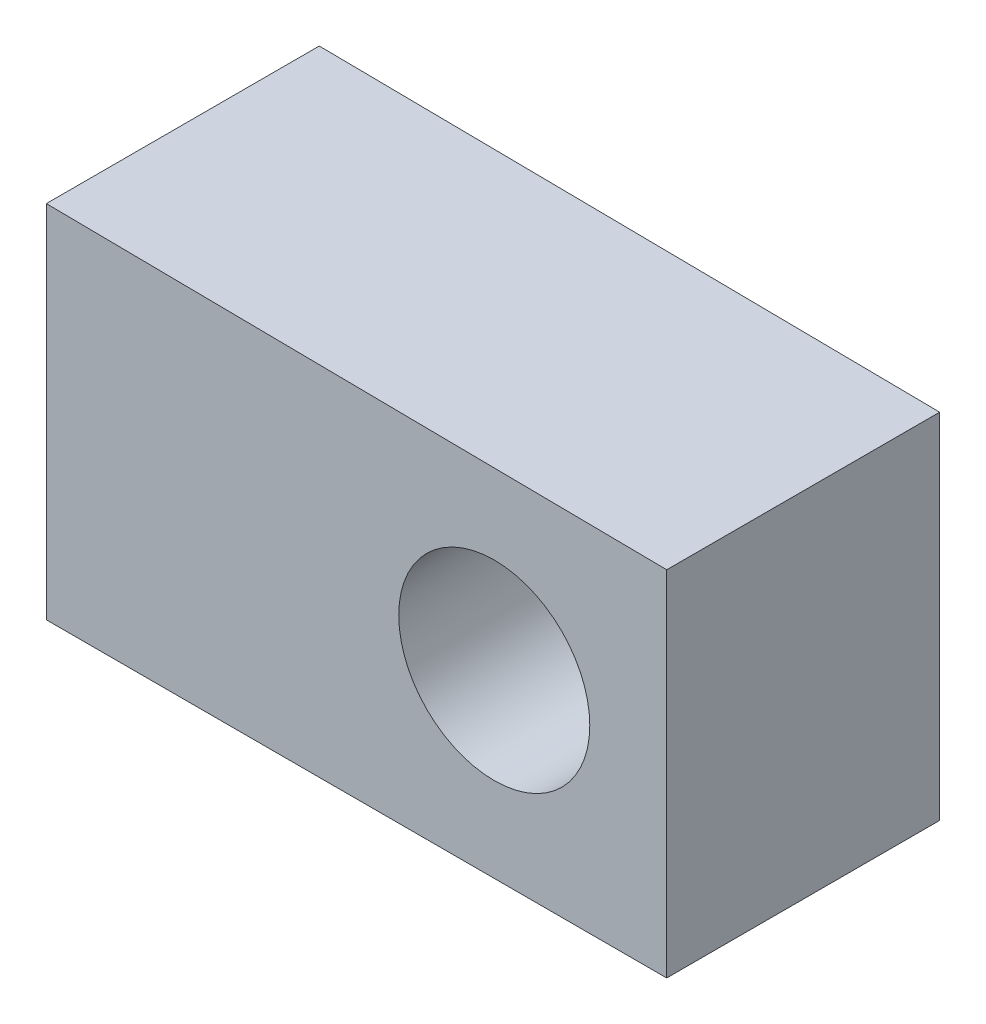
ISO-10303-21;
HEADER;
FILE_DESCRIPTION(('STEP AP214'),'2;1');
FILE_NAME('part.step','',(''),(''),'','','');
FILE_SCHEMA(('AUTOMOTIVE_DESIGN { 1 0 10303 214 1 1 1 1 }'));
ENDSEC;
DATA;
#1=APPLICATION_CONTEXT('core data for automotive mechanical design processes');
#2=APPLICATION_PROTOCOL_DEFINITION('international standard','automotive_design',2000,#1);
#3=PRODUCT_CONTEXT('',#1,'mechanical');
#4=PRODUCT('Part','Part','',(#3));
#5=PRODUCT_RELATED_PRODUCT_CATEGORY('part','',(#4));
#6=PRODUCT_DEFINITION_FORMATION('','',#4);
#7=PRODUCT_DEFINITION_CONTEXT('part definition',#1,'design');
#8=PRODUCT_DEFINITION('design','',#6,#7);
#9=PRODUCT_DEFINITION_SHAPE('','',#8);
#10=(LENGTH_UNIT() NAMED_UNIT(*) SI_UNIT(.MILLI.,.METRE.));
#11=(NAMED_UNIT(*) PLANE_ANGLE_UNIT() SI_UNIT($,.RADIAN.));
#12=(NAMED_UNIT(*) SI_UNIT($,.STERADIAN.) SOLID_ANGLE_UNIT());
#13=UNCERTAINTY_MEASURE_WITH_UNIT(LENGTH_MEASURE(1.E-05),#10,'distance_accuracy_value','');
#14=(GEOMETRIC_REPRESENTATION_CONTEXT(3) GLOBAL_UNCERTAINTY_ASSIGNED_CONTEXT((#13)) GLOBAL_UNIT_ASSIGNED_CONTEXT((#10,
#11,#12)) REPRESENTATION_CONTEXT('',''));
#15=CARTESIAN_POINT('',(0.,0.,0.));
#16=DIRECTION('',(0.,0.,1.));
#17=DIRECTION('',(1.,0.,0.));
#18=AXIS2_PLACEMENT_3D('',#15,#16,#17);
#19=CARTESIAN_POINT('',(0.,0.,10.));
#20=DIRECTION('',(0.,0.,-1.));
#21=DIRECTION('',(-1.,0.,0.));
#22=AXIS2_PLACEMENT_3D('',#19,#20,#21);
#23=PLANE('',#22);
#24=DIRECTION('',(-0.999937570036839,0.0111738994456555,0.));
#25=VECTOR('',#24,1.);
#26=CARTESIAN_POINT('',(31518.8657143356,62891.7491711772,10.));
#27=LINE('',#26,#25);
#28=CARTESIAN_POINT('',(31541.595840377,62891.4951711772,10.));
#29=VERTEX_POINT('',#28);
#30=CARTESIAN_POINT('',(31518.8657143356,62891.7491711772,10.));
#31=VERTEX_POINT('',#30);
#32=EDGE_CURVE('E85',#29,#31,#27,.T.);
#33=ORIENTED_EDGE('',*,*,#32,.T.);
#34=DIRECTION('',(8.06945868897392E-13,-1.,0.));
#35=VECTOR('',#34,1.);
#36=CARTESIAN_POINT('',(31518.8657143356,62878.5411711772,10.));
#37=LINE('',#36,#35);
#38=CARTESIAN_POINT('',(31518.8657143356,62878.5411711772,10.));
#39=VERTEX_POINT('',#38);
#40=EDGE_CURVE('E80',#31,#39,#37,.T.);
#41=ORIENTED_EDGE('',*,*,#40,.T.);
#42=DIRECTION('',(1.,1.5629977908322E-12,0.));
#43=VECTOR('',#42,1.);
#44=CARTESIAN_POINT('',(31541.595840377,62878.5411711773,10.));
#45=LINE('',#44,#43);
#46=CARTESIAN_POINT('',(31541.595840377,62878.5411711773,10.));
#47=VERTEX_POINT('',#46);
#48=EDGE_CURVE('E83',#39,#47,#45,.T.);
#49=ORIENTED_EDGE('',*,*,#48,.T.);
#50=DIRECTION('',(-1.09702444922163E-12,1.,0.));
#51=VECTOR('',#50,1.);
#52=CARTESIAN_POINT('',(31541.595840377,62891.4951711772,10.));
#53=LINE('',#52,#51);
#54=EDGE_CURVE('E50',#47,#29,#53,.T.);
#55=ORIENTED_EDGE('',*,*,#54,.T.);
#56=EDGE_LOOP('',(#33,#41,#49,#55));
#57=FACE_BOUND('',#56,.T.);
#58=CARTESIAN_POINT('',(31535.2771043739,62885.1453563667,10.));
#59=DIRECTION('',(0.,0.,1.));
#60=DIRECTION('',(1.,0.,0.));
#61=AXIS2_PLACEMENT_3D('',#58,#59,#60);
#62=CIRCLE('',#61,3.49999999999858);
#63=CARTESIAN_POINT('',(31538.7771043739,62885.1453563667,10.));
#64=VERTEX_POINT('',#63);
#65=EDGE_CURVE('E100',#64,#64,#62,.T.);
#66=ORIENTED_EDGE('',*,*,#65,.F.);
#67=EDGE_LOOP('',(#66));
#68=FACE_BOUND('',#67,.T.);
#69=ADVANCED_FACE('F33',(#57,#68),#23,.F.);
#70=CARTESIAN_POINT('',(0.,0.,0.));
#71=DIRECTION('',(0.,0.,-1.));
#72=DIRECTION('',(-1.,0.,0.));
#73=AXIS2_PLACEMENT_3D('',#70,#71,#72);
#74=PLANE('',#73);
#75=DIRECTION('',(-0.999937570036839,0.0111738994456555,0.));
#76=VECTOR('',#75,1.);
#77=CARTESIAN_POINT('',(31518.8657143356,62891.7491711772,0.));
#78=LINE('',#77,#76);
#79=CARTESIAN_POINT('',(31541.595840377,62891.4951711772,0.));
#80=VERTEX_POINT('',#79);
#81=CARTESIAN_POINT('',(31518.8657143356,62891.7491711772,0.));
#82=VERTEX_POINT('',#81);
#83=EDGE_CURVE('E97',#80,#82,#78,.T.);
#84=ORIENTED_EDGE('',*,*,#83,.F.);
#85=DIRECTION('',(-1.09702444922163E-12,1.,0.));
#86=VECTOR('',#85,1.);
#87=CARTESIAN_POINT('',(31541.595840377,62891.4951711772,0.));
#88=LINE('',#87,#86);
#89=CARTESIAN_POINT('',(31541.595840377,62878.5411711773,0.));
#90=VERTEX_POINT('',#89);
#91=EDGE_CURVE('E73',#90,#80,#88,.T.);
#92=ORIENTED_EDGE('',*,*,#91,.F.);
#93=DIRECTION('',(1.,1.5629977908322E-12,0.));
#94=VECTOR('',#93,1.);
#95=CARTESIAN_POINT('',(31541.595840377,62878.5411711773,0.));
#96=LINE('',#95,#94);
#97=CARTESIAN_POINT('',(31518.8657143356,62878.5411711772,0.));
#98=VERTEX_POINT('',#97);
#99=EDGE_CURVE('E67',#98,#90,#96,.T.);
#100=ORIENTED_EDGE('',*,*,#99,.F.);
#101=DIRECTION('',(8.06945868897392E-13,-1.,0.));
#102=VECTOR('',#101,1.);
#103=CARTESIAN_POINT('',(31518.8657143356,62878.5411711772,0.));
#104=LINE('',#103,#102);
#105=EDGE_CURVE('E89',#82,#98,#104,.T.);
#106=ORIENTED_EDGE('',*,*,#105,.F.);
#107=EDGE_LOOP('',(#84,#92,#100,#106));
#108=FACE_BOUND('',#107,.T.);
#109=CARTESIAN_POINT('',(31535.2771043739,62885.1453563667,0.));
#110=DIRECTION('',(0.,0.,1.));
#111=DIRECTION('',(1.,0.,0.));
#112=AXIS2_PLACEMENT_3D('',#109,#110,#111);
#113=CIRCLE('',#112,3.49999999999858);
#114=CARTESIAN_POINT('',(31538.7771043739,62885.1453563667,0.));
#115=VERTEX_POINT('',#114);
#116=EDGE_CURVE('E112',#115,#115,#113,.T.);
#117=ORIENTED_EDGE('',*,*,#116,.T.);
#118=EDGE_LOOP('',(#117));
#119=FACE_BOUND('',#118,.T.);
#120=ADVANCED_FACE('F108',(#108,#119),#74,.T.);
#121=CARTESIAN_POINT('',(31518.8657143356,62891.7491711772,10.));
#122=DIRECTION('',(-0.0111738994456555,-0.999937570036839,0.));
#123=DIRECTION('',(0.999937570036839,-0.0111738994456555,0.));
#124=AXIS2_PLACEMENT_3D('',#121,#122,#123);
#125=PLANE('',#124);
#126=ORIENTED_EDGE('',*,*,#83,.T.);
#127=DIRECTION('',(0.,0.,-1.));
#128=VECTOR('',#127,1.);
#129=CARTESIAN_POINT('',(31518.8657143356,62891.7491711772,10.));
#130=LINE('',#129,#128);
#131=EDGE_CURVE('E11',#31,#82,#130,.T.);
#132=ORIENTED_EDGE('',*,*,#131,.F.);
#133=ORIENTED_EDGE('',*,*,#32,.F.);
#134=DIRECTION('',(0.,0.,-1.));
#135=VECTOR('',#134,1.);
#136=CARTESIAN_POINT('',(31541.595840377,62891.4951711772,10.));
#137=LINE('',#136,#135);
#138=EDGE_CURVE('E93',#29,#80,#137,.T.);
#139=ORIENTED_EDGE('',*,*,#138,.T.);
#140=EDGE_LOOP('',(#126,#132,#133,#139));
#141=FACE_BOUND('',#140,.T.);
#142=ADVANCED_FACE('F35',(#141),#125,.F.);
#143=CARTESIAN_POINT('',(31518.8657143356,62878.5411711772,10.));
#144=DIRECTION('',(1.,8.06945868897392E-13,0.));
#145=DIRECTION('',(-8.06945868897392E-13,1.,0.));
#146=AXIS2_PLACEMENT_3D('',#143,#144,#145);
#147=PLANE('',#146);
#148=ORIENTED_EDGE('',*,*,#105,.T.);
#149=DIRECTION('',(0.,0.,-1.));
#150=VECTOR('',#149,1.);
#151=CARTESIAN_POINT('',(31518.8657143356,62878.5411711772,10.));
#152=LINE('',#151,#150);
#153=EDGE_CURVE('E42',#39,#98,#152,.T.);
#154=ORIENTED_EDGE('',*,*,#153,.F.);
#155=ORIENTED_EDGE('',*,*,#40,.F.);
#156=ORIENTED_EDGE('',*,*,#131,.T.);
#157=EDGE_LOOP('',(#148,#154,#155,#156));
#158=FACE_BOUND('',#157,.T.);
#159=ADVANCED_FACE('F88',(#158),#147,.F.);
#160=CARTESIAN_POINT('',(31541.595840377,62878.5411711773,10.));
#161=DIRECTION('',(-1.56299779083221E-12,1.,0.));
#162=DIRECTION('',(-1.,-1.56299779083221E-12,0.));
#163=AXIS2_PLACEMENT_3D('',#160,#161,#162);
#164=PLANE('',#163);
#165=ORIENTED_EDGE('',*,*,#99,.T.);
#166=DIRECTION('',(0.,0.,-1.));
#167=VECTOR('',#166,1.);
#168=CARTESIAN_POINT('',(31541.595840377,62878.5411711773,10.));
#169=LINE('',#168,#167);
#170=EDGE_CURVE('E90',#47,#90,#169,.T.);
#171=ORIENTED_EDGE('',*,*,#170,.F.);
#172=ORIENTED_EDGE('',*,*,#48,.F.);
#173=ORIENTED_EDGE('',*,*,#153,.T.);
#174=EDGE_LOOP('',(#165,#171,#172,#173));
#175=FACE_BOUND('',#174,.T.);
#176=ADVANCED_FACE('F91',(#175),#164,.F.);
#177=CARTESIAN_POINT('',(31541.595840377,62891.4951711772,10.));
#178=DIRECTION('',(-1.,-1.09702444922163E-12,0.));
#179=DIRECTION('',(1.09702444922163E-12,-1.,0.));
#180=AXIS2_PLACEMENT_3D('',#177,#178,#179);
#181=PLANE('',#180);
#182=ORIENTED_EDGE('',*,*,#91,.T.);
#183=ORIENTED_EDGE('',*,*,#138,.F.);
#184=ORIENTED_EDGE('',*,*,#54,.F.);
#185=ORIENTED_EDGE('',*,*,#170,.T.);
#186=EDGE_LOOP('',(#182,#183,#184,#185));
#187=FACE_BOUND('',#186,.T.);
#188=ADVANCED_FACE('F105',(#187),#181,.F.);
#189=CARTESIAN_POINT('',(31535.2771043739,62885.1453563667,10.));
#190=DIRECTION('',(0.,0.,-1.));
#191=DIRECTION('',(-1.,0.,0.));
#192=AXIS2_PLACEMENT_3D('',#189,#190,#191);
#193=CYLINDRICAL_SURFACE('',#192,3.49999999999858);
#194=ORIENTED_EDGE('',*,*,#65,.T.);
#195=EDGE_LOOP('',(#194));
#196=FACE_BOUND('',#195,.T.);
#197=ORIENTED_EDGE('',*,*,#116,.F.);
#198=EDGE_LOOP('',(#197));
#199=FACE_BOUND('',#198,.T.);
#200=ADVANCED_FACE('F118',(#196,#199),#193,.F.);
#201=CLOSED_SHELL('',(#69,#120,#142,#159,#176,#188,#200));
#202=MANIFOLD_SOLID_BREP('B2',#201);
#203=ADVANCED_BREP_SHAPE_REPRESENTATION('',(#18,#202),#14);
#204=SHAPE_DEFINITION_REPRESENTATION(#9,#203);
ENDSEC;
END-ISO-10303-21;
